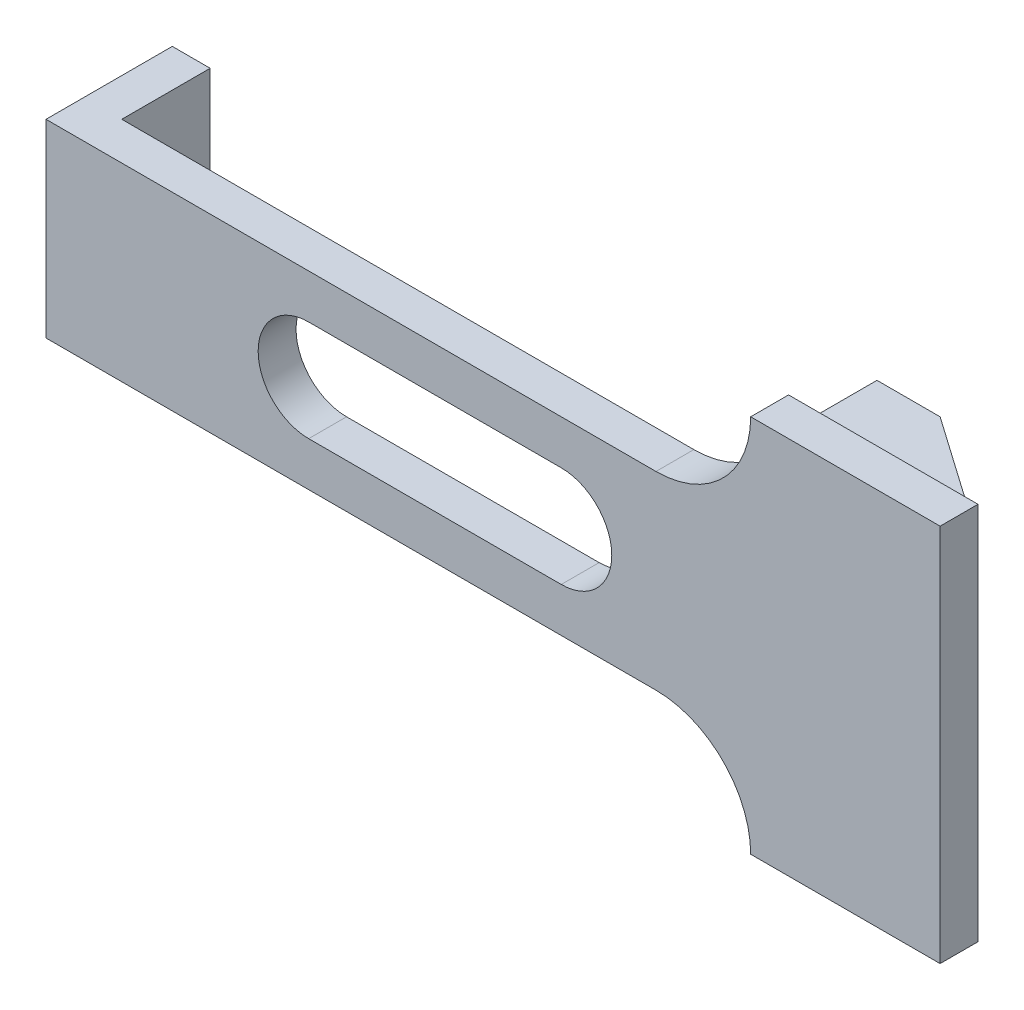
from build123d import *

# Parameters (mm, degrees)
LINEAR_AUSTRAGEN1_DEPTH = 15
LINEAR_AUSTRAGEN2_DEPTH = 74.059154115
LANGLOCH_DEPTH          = 30
LINEAR_AUSTRAGEN4_REACH = 75.059
SKIZZE4_W               = 7
SKIZZE4_H               = 2.5


with BuildPart() as part:
    # Skizze1 → Linear austragen1 (new, symmetric)
    with BuildSketch(Plane(origin=(0, 0, 0), x_dir=(1, 0, 0), z_dir=(0, 1, 0))):
        Polygon((0, 0), (70.8, 0), (70.8, 3), (60.8, 10), (55.8, 10), (55.8, 3), (3, 3), (3, 10), (0, 10), align=None)
    extrude(amount=LINEAR_AUSTRAGEN1_DEPTH, both=True)

    # Skizze2 → Linear austragen2 (cut, through all)
    with BuildSketch(Plane.XY):
        with BuildLine():
            Line((0, 7.5), (48.3, 7.5))
            ThreePointArc((48.3, 7.5), (53.603300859, 9.696699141), (55.8, 15))
            Line((55.8, 15), (0, 15))
            Line((0, 15), (0, 7.5))
        make_face()
    linear_austragen2 = extrude(amount=-LINEAR_AUSTRAGEN2_DEPTH, mode=Mode.SUBTRACT)

    # Spiegeln1: Linear austragen2 across plane
    add(linear_austragen2.mirror(Plane.ZX), mode=Mode.SUBTRACT)

    # Skizze3 → Langloch (cut)
    with BuildSketch(Plane.XY):
        with BuildLine():
            Line((20.8, 4), (40.8, 4))
            ThreePointArc((40.8, 4), (44.8, 0), (40.8, -4))
            Line((40.8, -4), (20.8, -4))
            ThreePointArc((20.8, -4), (16.8, 0), (20.8, 4))
        make_face()
    extrude(amount=-LANGLOCH_DEPTH, mode=Mode.SUBTRACT)

    # Skizze4 → Linear austragen4 (cut, up to next)
    with BuildSketch(Plane(origin=(70.8, 0, 0), x_dir=(0, 0, -1), z_dir=(1, 0, 0)), mode=Mode.PRIVATE) as linear_austragen4_sk1:
        with Locations((6.5, 13.75)):
            Rectangle(SKIZZE4_W, SKIZZE4_H)
    linear_austragen4_tool1 = extrude(linear_austragen4_sk1.sketch, amount=-LINEAR_AUSTRAGEN4_REACH, mode=Mode.PRIVATE) & part.part
    # Skizze4 → Linear austragen4 (cut, up to next)
    with BuildSketch(Plane(origin=(70.8, 0, 0), x_dir=(0, 0, -1), z_dir=(1, 0, 0)), mode=Mode.PRIVATE) as linear_austragen4_sk2:
        with Locations((6.5, -13.75)):
            Rectangle(SKIZZE4_W, SKIZZE4_H)
    linear_austragen4_tool2 = extrude(linear_austragen4_sk2.sketch, amount=-LINEAR_AUSTRAGEN4_REACH, mode=Mode.PRIVATE) & part.part
    add(linear_austragen4_tool1.solids().sort_by_distance((70.8, 13.75, -6.5))[0], mode=Mode.SUBTRACT)
    add(linear_austragen4_tool2.solids().sort_by_distance((70.8, -13.75, -6.5))[0], mode=Mode.SUBTRACT)


solid = part.part
